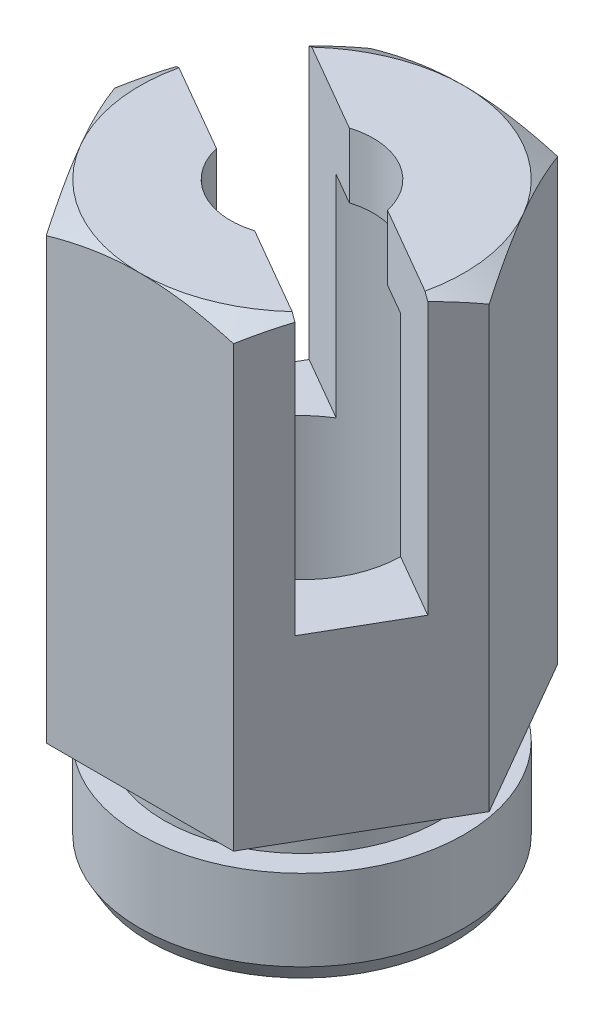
from build123d import *

# Parameters (mm, degrees)
BOSS_EXTRU_1_DEPTH      = 14
ESQUISSE3_R             = 4.25
BOSS_EXTRU_2_DEPTH      = 1
ESQUISSE4_R             = 5
BOSS_EXTRU_3_DEPTH      = 3
CHANFREIN1_SIZE         = 0.5
CHANFREIN1_SIZE2        = 0.288675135
ESQUISSE5_R             = 3.1
ENL_V_MAT_EXTRU_1_DEPTH = 16
CHANFREIN2_SIZE         = 0.5
CHANFREIN2_SIZE2        = 0.288675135
ESQUISSE6_W             = 3
ESQUISSE6_H             = 8.5
ENL_V_MAT_EXTRU_2_DEPTH = 19.823743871
ESQUISSE7_R             = 2.2
ENL_V_MAT_EXTRU_3_DEPTH = 20.553345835


with BuildPart() as part:
    # Esquisse1 → Boss.-Extru.1 (new body)
    with BuildSketch(Plane(origin=(0, 0, 0), x_dir=(1, 0, 0), z_dir=(0, 1, 0))):
        Polygon((5.773502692, 0), (2.886751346, 5), (-2.886751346, 5), (-5.773502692, 0), (-2.886751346, -5), (2.886751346, -5), align=None)
    extrude(amount=BOSS_EXTRU_1_DEPTH)

    # Esquisse2 → Enl_vement de mati_re-R_volution1 (revolve, cut)
    with BuildSketch(Plane(origin=(0, 0, 0), x_dir=(0, 0, -1), z_dir=(1, 0, 0))):
        Polygon((5, 14), (10, 14), (10, 11.113248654), align=None)
    revolve(axis=Axis((0, 17.861039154, 0), (0, -1, 0)), mode=Mode.SUBTRACT)

    # Esquisse3 → Boss.-Extru.2 (add)
    with BuildSketch(Plane.XZ):
        with Locations(Location((0, 0, 0), (0, 0, 90))):
            Circle(ESQUISSE3_R)
    extrude(amount=BOSS_EXTRU_2_DEPTH)

    # Esquisse4 → Boss.-Extru.3 (add)
    with BuildSketch(Plane.XZ.offset(1)):
        with Locations(Location((0, 0, 0), (0, 0, 270))):
            Circle(ESQUISSE4_R)
    extrude(amount=BOSS_EXTRU_3_DEPTH)

    # Chanfrein1
    chanfrein1_edges = [part.edges().sort_by_distance(p)[0] for p in [
        (0, -4, 5),
    ]]
    chanfrein1_side = [part.faces().sort_by_distance(p)[0] for p in [
        (0, -2.5, 5),
    ]]
    chamfer(chanfrein1_edges, length=CHANFREIN1_SIZE, length2=CHANFREIN1_SIZE2, reference=chanfrein1_side[0])

    # Esquisse5 → Enl_v. mat.-Extru.1 (cut)
    with BuildSketch(Plane.XZ.offset(4)):
        with Locations(Location((0, 0, 0), (0, 0, 270))):
            Circle(ESQUISSE5_R)
    extrude(amount=-ENL_V_MAT_EXTRU_1_DEPTH, mode=Mode.SUBTRACT)

    # Chanfrein2
    chanfrein2_edges = [part.edges().sort_by_distance(p)[0] for p in [
        (0, -4, 3.1),
    ]]
    chanfrein2_side = [part.faces().sort_by_distance(p)[0] for p in [
        (0, -4, 4.578068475),
    ]]
    chamfer(chanfrein2_edges, length=CHANFREIN2_SIZE, length2=CHANFREIN2_SIZE2, reference=chanfrein2_side[0])

    # Esquisse6 → Enl_v. mat.-Extru.2 (cut, through all)
    with BuildSketch(Plane(origin=(4.330127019, 0, 2.5), x_dir=(0.49999999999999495, 0, -0.8660254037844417), z_dir=(0.8660254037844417, 0, 0.49999999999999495))):
        with Locations((0, 9.75)):
            Rectangle(ESQUISSE6_W, ESQUISSE6_H)
    extrude(amount=-ENL_V_MAT_EXTRU_2_DEPTH, mode=Mode.SUBTRACT)

    # Esquisse7 → Enl_v. mat.-Extru.3 (cut, through all)
    with BuildSketch(Plane(origin=(0, 14, 0), x_dir=(1, 0, 0), z_dir=(0, 1, 0))):
        Circle(ESQUISSE7_R)
    extrude(amount=-ENL_V_MAT_EXTRU_3_DEPTH, mode=Mode.SUBTRACT)


solid = part.part
